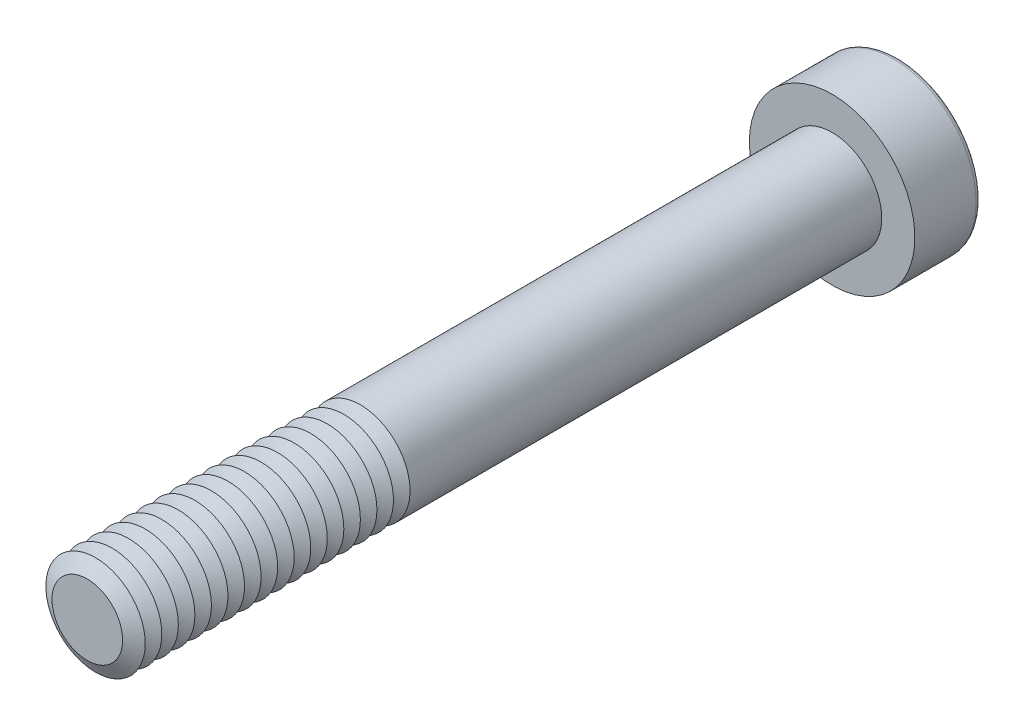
from build123d import *

# Parameters (mm, degrees)
SKETCH1_R           = 3
BOSS_EXTRUDE1_DEPTH = 45
SKETCH2_R           = 5
BOSS_EXTRUDE2_DEPTH = 4
CUT_EXTRUDE1_DEPTH  = 3
FILLET1_R           = 0.3
LPATTERN1_COUNT     = 17
LPATTERN1_PITCH     = 1


with BuildPart() as part:
    # Sketch1 → Boss-Extrude1 (new body)
    with BuildSketch(Plane.XY):
        with Locations(Location((0, 0, 0), (0, 0, 180))):
            Circle(SKETCH1_R)
    extrude(amount=BOSS_EXTRUDE1_DEPTH)

    # Sketch2 → Boss-Extrude2 (add)
    with BuildSketch(Plane(origin=(0, 0, 0), x_dir=(-1, 0, 0), z_dir=(0, 0, -1))):
        Circle(SKETCH2_R)
    extrude(amount=BOSS_EXTRUDE2_DEPTH)

    # Sketch3 → Cut-Extrude1 (cut)
    with BuildSketch(Plane(origin=(0, 0, -4), x_dir=(-1, 0, 0), z_dir=(0, 0, -1))):
        Polygon((-1.154700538, 2), (-2.309401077, 0), (-1.154700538, -2), (1.154700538, -2), (2.309401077, 0), (1.154700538, 2), align=None)
    extrude(amount=-CUT_EXTRUDE1_DEPTH, mode=Mode.SUBTRACT)

    # Fillet1
    fillet1_edges = [part.edges().sort_by_distance(p)[0] for p in [
        (5, 0, -4),
    ]]
    fillet(fillet1_edges, radius=FILLET1_R)

    # Cut-Extrude2 cone 1 section (on through the dimple's axis) → Cut-Extrude2 (revolve, cut)
    with BuildSketch(Plane(origin=(0, 0, -1), x_dir=(0, 1, 0), z_dir=(1, 0, 0))):
        Polygon((0, 0), (2, 0), (0, 1.154700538), align=None)
    revolve(axis=Axis((0, 0, -1), (0, 0, 1)), mode=Mode.SUBTRACT)

    # Cut-Extrude3 cone 1 section (on through the dimple's axis) → Cut-Extrude3 (revolve, cut)
    with BuildSketch(Plane(origin=(0, 0, -4), x_dir=(0, 1, 0), z_dir=(1, 0, 0))):
        Polygon((0, 0), (2.309401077, 0), (0, 0.618802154), align=None)
    revolve(axis=Axis((0, 0, -4), (0, 0, 1)), mode=Mode.SUBTRACT)

    # Sketch7 → Cut-Revolve1 (revolve, cut)
    with BuildSketch(Plane(origin=(0, 0, 0), x_dir=(0, 0, -1), z_dir=(1, 0, 0)), mode=Mode.PRIVATE) as cut_revolve1_sk:
        Polygon((-45, 2.133974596), (-44.5, 3), (-45.5, 3), align=None)
    cut_revolve1 = revolve(cut_revolve1_sk.sketch.rotate(Axis((0, 0, 45), (0, 0, -1)), 270), axis=Axis((0, 0, 45), (0, 0, -1)), mode=Mode.SUBTRACT)

    # LPattern1: Cut-Revolve1 ×17
    with Locations(*[(0, 0, -i * LPATTERN1_PITCH) for i in range(1, LPATTERN1_COUNT)]):
        add(cut_revolve1, mode=Mode.SUBTRACT)


solid = part.part
